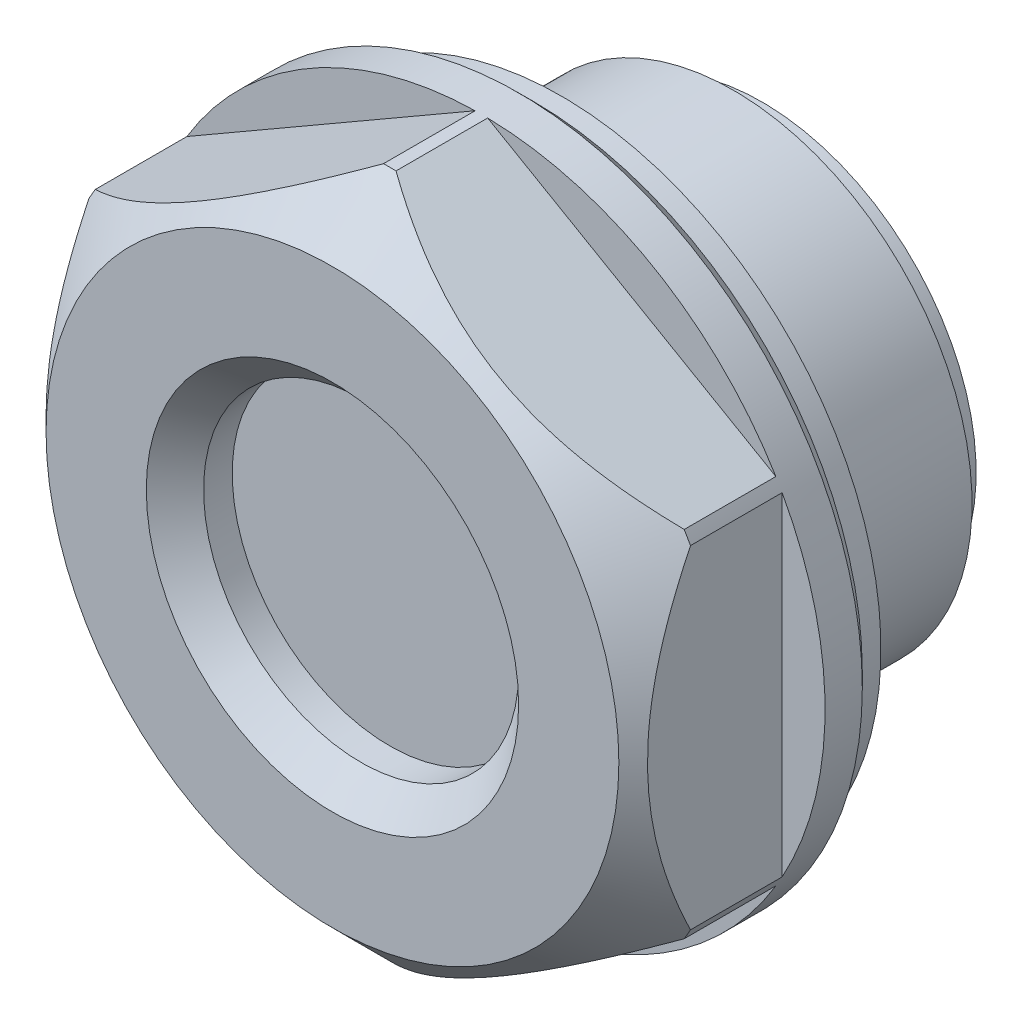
ISO-10303-21;
HEADER;
FILE_DESCRIPTION(('STEP AP214'),'2;1');
FILE_NAME('part.step','',(''),(''),'','','');
FILE_SCHEMA(('AUTOMOTIVE_DESIGN { 1 0 10303 214 1 1 1 1 }'));
ENDSEC;
DATA;
#1=APPLICATION_CONTEXT('core data for automotive mechanical design processes');
#2=APPLICATION_PROTOCOL_DEFINITION('international standard','automotive_design',2000,#1);
#3=PRODUCT_CONTEXT('',#1,'mechanical');
#4=PRODUCT('Part','Part','',(#3));
#5=PRODUCT_RELATED_PRODUCT_CATEGORY('part','',(#4));
#6=PRODUCT_DEFINITION_FORMATION('','',#4);
#7=PRODUCT_DEFINITION_CONTEXT('part definition',#1,'design');
#8=PRODUCT_DEFINITION('design','',#6,#7);
#9=PRODUCT_DEFINITION_SHAPE('','',#8);
#10=(LENGTH_UNIT() NAMED_UNIT(*) SI_UNIT(.MILLI.,.METRE.));
#11=(NAMED_UNIT(*) PLANE_ANGLE_UNIT() SI_UNIT($,.RADIAN.));
#12=(NAMED_UNIT(*) SI_UNIT($,.STERADIAN.) SOLID_ANGLE_UNIT());
#13=UNCERTAINTY_MEASURE_WITH_UNIT(LENGTH_MEASURE(1.E-05),#10,'distance_accuracy_value','');
#14=(GEOMETRIC_REPRESENTATION_CONTEXT(3) GLOBAL_UNCERTAINTY_ASSIGNED_CONTEXT((#13)) GLOBAL_UNIT_ASSIGNED_CONTEXT((#10,
#11,#12)) REPRESENTATION_CONTEXT('',''));
#15=CARTESIAN_POINT('',(0.,0.,0.));
#16=DIRECTION('',(0.,0.,1.));
#17=DIRECTION('',(1.,0.,0.));
#18=AXIS2_PLACEMENT_3D('',#15,#16,#17);
#19=CARTESIAN_POINT('',(0.,0.,8.));
#20=DIRECTION('',(0.,0.,-1.));
#21=DIRECTION('',(-1.,0.,0.));
#22=AXIS2_PLACEMENT_3D('',#19,#20,#21);
#23=CONICAL_SURFACE('',#22,10.,0.785398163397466);
#24=CARTESIAN_POINT('',(0.,0.,8.));
#25=DIRECTION('',(0.,0.,-1.));
#26=DIRECTION('',(-1.,0.,0.));
#27=AXIS2_PLACEMENT_3D('',#24,#25,#26);
#28=CIRCLE('',#27,10.);
#29=CARTESIAN_POINT('',(-10.,0.,8.));
#30=VERTEX_POINT('',#29);
#31=EDGE_CURVE('E220',#30,#30,#28,.T.);
#32=ORIENTED_EDGE('',*,*,#31,.T.);
#33=EDGE_LOOP('',(#32));
#34=FACE_BOUND('',#33,.T.);
#35=CARTESIAN_POINT('',(0.,0.,6.00000000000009));
#36=DIRECTION('',(0.,0.,-1.));
#37=DIRECTION('',(-1.,0.,0.));
#38=AXIS2_PLACEMENT_3D('',#35,#36,#37);
#39=CIRCLE('',#38,12.);
#40=CARTESIAN_POINT('',(-10.2811529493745,-6.18852923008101,6.0000000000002));
#41=VERTEX_POINT('',#40);
#42=CARTESIAN_POINT('',(-10.5,-5.80947501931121,6.00000000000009));
#43=VERTEX_POINT('',#42);
#44=EDGE_CURVE('E222',#41,#43,#39,.T.);
#45=ORIENTED_EDGE('',*,*,#44,.F.);
#46=CARTESIAN_POINT('',(-10.2813529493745,-6.18841376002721,5.9998881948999));
#47=CARTESIAN_POINT('',(-10.1071583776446,-6.28898504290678,6.09725022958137));
#48=CARTESIAN_POINT('',(-9.93167547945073,-6.39030014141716,6.19149656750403));
#49=CARTESIAN_POINT('',(-9.57786885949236,-6.59457048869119,6.37286421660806));
#50=CARTESIAN_POINT('',(-9.39954375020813,-6.69752653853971,6.45998191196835));
#51=CARTESIAN_POINT('',(-8.85846736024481,-7.00991713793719,6.70994526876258));
#52=CARTESIAN_POINT('',(-8.49126575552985,-7.22192108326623,6.86045836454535));
#53=CARTESIAN_POINT('',(-7.93494901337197,-7.54311070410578,7.0537218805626));
#54=CARTESIAN_POINT('',(-7.74992935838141,-7.64993185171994,7.11241954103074));
#55=CARTESIAN_POINT('',(-7.37748020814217,-7.86496546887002,7.21846513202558));
#56=CARTESIAN_POINT('',(-7.1900512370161,-7.97317763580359,7.26581548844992));
#57=CARTESIAN_POINT('',(-6.81351822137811,-8.19056907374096,7.34805197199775));
#58=CARTESIAN_POINT('',(-6.62441815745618,-8.29974604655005,7.38296223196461));
#59=CARTESIAN_POINT('',(-6.24476910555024,-8.51893652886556,7.43959542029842));
#60=CARTESIAN_POINT('',(-6.05422030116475,-8.62894993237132,7.46131999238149));
#61=CARTESIAN_POINT('',(-5.57903999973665,-8.90329540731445,7.49821883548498));
#62=CARTESIAN_POINT('',(-5.29388349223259,-9.06793059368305,7.50502017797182));
#63=CARTESIAN_POINT('',(-4.72422477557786,-9.39682320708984,7.48760906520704));
#64=CARTESIAN_POINT('',(-4.43972281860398,-9.5610804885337,7.46338618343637));
#65=CARTESIAN_POINT('',(-3.87355290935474,-9.88795883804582,7.38535655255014));
#66=CARTESIAN_POINT('',(-3.59188790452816,-10.0505782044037,7.33152173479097));
#67=CARTESIAN_POINT('',(-3.03346083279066,-10.3729862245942,7.19716647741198));
#68=CARTESIAN_POINT('',(-2.75669833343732,-10.5327751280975,7.11664840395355));
#69=CARTESIAN_POINT('',(-2.28772625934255,-10.8035362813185,6.95900643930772));
#70=CARTESIAN_POINT('',(-2.09405788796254,-10.9153507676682,6.88754708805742));
#71=CARTESIAN_POINT('',(-1.70984459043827,-11.1371764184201,6.73425751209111));
#72=CARTESIAN_POINT('',(-1.51929943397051,-11.2471877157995,6.65242805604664));
#73=CARTESIAN_POINT('',(-1.14195874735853,-11.4650454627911,6.47995661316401));
#74=CARTESIAN_POINT('',(-0.955153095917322,-11.5728977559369,6.38934393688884));
#75=CARTESIAN_POINT('',(-0.584628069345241,-11.7868204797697,6.20024466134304));
#76=CARTESIAN_POINT('',(-0.400907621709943,-11.8928915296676,6.10176086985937));
#77=CARTESIAN_POINT('',(-0.218647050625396,-11.9981197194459,5.9998881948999));
#78=B_SPLINE_CURVE_WITH_KNOTS('',3,(#46,#47,#48,#49,#50,#51,#52,#53,#54,#55,#56,#57,#58,#59,#60,
#61,#62,#63,#64,#65,#66,#67,#68,#69,#70,#71,#72,#73,#74,#75,#76,#77),.UNSPECIFIED.,.F.,.F.,(4,2,
2,2,2,2,2,2,2,2,2,2,2,2,2,4),(0.,0.670320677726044,1.34097927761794,2.68866206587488,
3.35309385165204,4.01738346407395,4.680377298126,5.34328846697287,6.32976728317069,
7.31657771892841,8.30432515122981,9.2919850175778,9.99603716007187,10.7000371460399,
11.4017637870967,12.1032412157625),.UNSPECIFIED.);
#79=CARTESIAN_POINT('',(-0.218847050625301,-11.9980042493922,6.00000000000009));
#80=VERTEX_POINT('',#79);
#81=EDGE_CURVE('E127',#41,#80,#78,.T.);
#82=ORIENTED_EDGE('',*,*,#81,.T.);
#83=CARTESIAN_POINT('',(0.218847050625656,-11.9980042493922,6.00000000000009));
#84=VERTEX_POINT('',#83);
#85=EDGE_CURVE('E225',#84,#80,#39,.T.);
#86=ORIENTED_EDGE('',*,*,#85,.F.);
#87=CARTESIAN_POINT('',(10.2813529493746,-6.18841376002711,5.9998881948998));
#88=CARTESIAN_POINT('',(10.1071583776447,-6.28898504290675,6.09725022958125));
#89=CARTESIAN_POINT('',(9.93167547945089,-6.39030014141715,6.19149656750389));
#90=CARTESIAN_POINT('',(9.57786885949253,-6.5945704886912,6.37286421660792));
#91=CARTESIAN_POINT('',(9.3995437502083,-6.69752653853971,6.45998191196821));
#92=CARTESIAN_POINT('',(8.85846736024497,-7.00991713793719,6.70994526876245));
#93=CARTESIAN_POINT('',(8.49126575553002,-7.22192108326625,6.86045836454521));
#94=CARTESIAN_POINT('',(7.93494901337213,-7.54311070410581,7.05372188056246));
#95=CARTESIAN_POINT('',(7.74992935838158,-7.64993185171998,7.1124195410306));
#96=CARTESIAN_POINT('',(7.37748020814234,-7.86496546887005,7.21846513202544));
#97=CARTESIAN_POINT('',(7.19005123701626,-7.97317763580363,7.26581548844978));
#98=CARTESIAN_POINT('',(6.81351822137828,-8.19056907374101,7.34805197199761));
#99=CARTESIAN_POINT('',(6.62441815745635,-8.29974604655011,7.38296223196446));
#100=CARTESIAN_POINT('',(6.24476910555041,-8.51893652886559,7.43959542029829));
#101=CARTESIAN_POINT('',(6.0542203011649,-8.62894993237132,7.46131999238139));
#102=CARTESIAN_POINT('',(5.5790399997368,-8.90329540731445,7.49821883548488));
#103=CARTESIAN_POINT('',(5.29388349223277,-9.06793059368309,7.50502017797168));
#104=CARTESIAN_POINT('',(4.72422477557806,-9.39682320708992,7.48760906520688));
#105=CARTESIAN_POINT('',(4.43972281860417,-9.56108048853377,7.46338618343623));
#106=CARTESIAN_POINT('',(3.87355290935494,-9.88795883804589,7.38535655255));
#107=CARTESIAN_POINT('',(3.59188790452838,-10.0505782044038,7.33152173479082));
#108=CARTESIAN_POINT('',(3.03346083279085,-10.3729862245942,7.19716647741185));
#109=CARTESIAN_POINT('',(2.75669833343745,-10.5327751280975,7.11664840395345));
#110=CARTESIAN_POINT('',(2.28772625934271,-10.8035362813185,6.95900643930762));
#111=CARTESIAN_POINT('',(2.09405788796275,-10.9153507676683,6.8875470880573));
#112=CARTESIAN_POINT('',(1.70984459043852,-11.1371764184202,6.73425751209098));
#113=CARTESIAN_POINT('',(1.51929943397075,-11.2471877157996,6.65242805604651));
#114=CARTESIAN_POINT('',(1.14195874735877,-11.4650454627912,6.47995661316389));
#115=CARTESIAN_POINT('',(0.955153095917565,-11.572897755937,6.38934393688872));
#116=CARTESIAN_POINT('',(0.584628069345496,-11.7868204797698,6.20024466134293));
#117=CARTESIAN_POINT('',(0.400907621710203,-11.8928915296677,6.10176086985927));
#118=CARTESIAN_POINT('',(0.218647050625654,-11.998119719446,5.9998881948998));
#119=B_SPLINE_CURVE_WITH_KNOTS('',3,(#87,#88,#89,#90,#91,#92,#93,#94,#95,#96,#97,#98,#99,#100,
#101,#102,#103,#104,#105,#106,#107,#108,#109,#110,#111,#112,#113,#114,#115,#116,#117,#118),
.UNSPECIFIED.,.F.,.F.,(4,2,2,2,2,2,2,2,2,2,2,2,2,2,2,4),(0.,0.670320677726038,1.34097927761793,
2.68866206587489,3.35309385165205,4.01738346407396,4.68037729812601,5.34328846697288,
6.32976728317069,7.31657771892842,8.30432515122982,9.2919850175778,9.99603716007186,
10.7000371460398,11.4017637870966,12.1032412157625),.UNSPECIFIED.);
#120=CARTESIAN_POINT('',(10.2811529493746,-6.18852923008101,6.00000000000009));
#121=VERTEX_POINT('',#120);
#122=EDGE_CURVE('E111',#121,#84,#119,.T.);
#123=ORIENTED_EDGE('',*,*,#122,.F.);
#124=CARTESIAN_POINT('',(10.5,-5.80947501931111,6.00000000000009));
#125=VERTEX_POINT('',#124);
#126=EDGE_CURVE('E228',#125,#121,#39,.T.);
#127=ORIENTED_EDGE('',*,*,#126,.F.);
#128=CARTESIAN_POINT('',(10.5,-12.032043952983,2.0306518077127));
#129=CARTESIAN_POINT('',(10.5,-11.7388121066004,2.25153591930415));
#130=CARTESIAN_POINT('',(10.5,-11.4439319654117,2.47026759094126));
#131=CARTESIAN_POINT('',(10.5,-10.8502274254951,2.90246444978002));
#132=CARTESIAN_POINT('',(10.5,-10.5514020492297,3.11592829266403));
#133=CARTESIAN_POINT('',(10.5,-9.94697374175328,3.53814509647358));
#134=CARTESIAN_POINT('',(10.5,-9.6413362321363,3.74684872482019));
#135=CARTESIAN_POINT('',(10.5,-9.02486334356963,4.15640757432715));
#136=CARTESIAN_POINT('',(10.5,-8.71402833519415,4.35726335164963));
#137=CARTESIAN_POINT('',(10.5,-8.06860183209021,4.76046591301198));
#138=CARTESIAN_POINT('',(10.5,-7.73366048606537,4.96225551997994));
#139=CARTESIAN_POINT('',(10.5,-7.05596601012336,5.35247531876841));
#140=CARTESIAN_POINT('',(10.5,-6.71321166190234,5.54090340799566));
#141=CARTESIAN_POINT('',(10.5,-6.01993639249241,5.90032914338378));
#142=CARTESIAN_POINT('',(10.5,-5.66944225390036,6.07137804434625));
#143=CARTESIAN_POINT('',(10.5,-4.95893344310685,6.3922167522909));
#144=CARTESIAN_POINT('',(10.5,-4.59892314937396,6.5420161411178));
#145=CARTESIAN_POINT('',(10.5,-3.89749178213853,6.8043230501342));
#146=CARTESIAN_POINT('',(10.5,-3.55682782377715,6.91883411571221));
#147=CARTESIAN_POINT('',(10.5,-2.86734915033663,7.12051813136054));
#148=CARTESIAN_POINT('',(10.5,-2.51853387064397,7.20768918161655));
#149=CARTESIAN_POINT('',(10.5,-1.82060908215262,7.34870759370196));
#150=CARTESIAN_POINT('',(10.5,-1.47161611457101,7.40312236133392));
#151=CARTESIAN_POINT('',(10.5,-0.769963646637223,7.47758125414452));
#152=CARTESIAN_POINT('',(10.5,-0.417304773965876,7.49763116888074));
#153=CARTESIAN_POINT('',(10.5,0.275709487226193,7.50189512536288));
#154=CARTESIAN_POINT('',(10.5,0.616057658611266,7.48735486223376));
#155=CARTESIAN_POINT('',(10.5,1.2938100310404,7.42597649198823));
#156=CARTESIAN_POINT('',(10.5,1.6312139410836,7.37913522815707));
#157=CARTESIAN_POINT('',(10.5,2.3063393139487,7.25490378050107));
#158=CARTESIAN_POINT('',(10.5,2.64396395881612,7.17699574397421));
#159=CARTESIAN_POINT('',(10.5,3.31186392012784,6.99476828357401));
#160=CARTESIAN_POINT('',(10.5,3.64213986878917,6.89045114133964));
#161=CARTESIAN_POINT('',(10.5,4.32659456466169,6.64847521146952));
#162=CARTESIAN_POINT('',(10.5,4.67996694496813,6.50855817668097));
#163=CARTESIAN_POINT('',(10.5,5.37752120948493,6.20726118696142));
#164=CARTESIAN_POINT('',(10.5,5.72169870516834,6.04587119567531));
#165=CARTESIAN_POINT('',(10.5,6.40255224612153,5.70546986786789));
#166=CARTESIAN_POINT('',(10.5,6.73920034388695,5.52640308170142));
#167=CARTESIAN_POINT('',(10.5,7.4047452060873,5.1546080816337));
#168=CARTESIAN_POINT('',(10.5,7.73364319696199,4.96188204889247));
#169=CARTESIAN_POINT('',(10.5,8.36850190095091,4.57533449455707));
#170=CARTESIAN_POINT('',(10.5,8.67478892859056,4.38204607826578));
#171=CARTESIAN_POINT('',(10.5,9.28210537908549,3.98735397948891));
#172=CARTESIAN_POINT('',(10.5,9.58313440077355,3.78594968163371));
#173=CARTESIAN_POINT('',(10.5,10.1781795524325,3.37814340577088));
#174=CARTESIAN_POINT('',(10.5,10.472232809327,3.17179540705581));
#175=CARTESIAN_POINT('',(10.5,11.0563228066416,2.7536521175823));
#176=CARTESIAN_POINT('',(10.5,11.3463606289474,2.54185833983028));
#177=CARTESIAN_POINT('',(10.5,11.6347173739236,2.32783842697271));
#178=B_SPLINE_CURVE_WITH_KNOTS('',3,(#128,#129,#130,#131,#132,#133,#134,#135,#136,#137,#138,
#139,#140,#141,#142,#143,#144,#145,#146,#147,#148,#149,#150,#151,#152,#153,#154,#155,#156,#157,
#158,#159,#160,#161,#162,#163,#164,#165,#166,#167,#168,#169,#170,#171,#172,#173,#174,#175,#176,
#177),.UNSPECIFIED.,.F.,.F.,(4,2,2,2,2,2,2,2,2,2,2,2,2,2,2,2,2,2,2,2,2,2,2,2,4),(0.,
1.1013722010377,2.20302261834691,3.31321111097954,4.4233207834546,5.5961640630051,
6.76919149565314,7.93865237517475,9.10758423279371,10.1848198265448,11.2621302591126,
12.320198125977,13.3780877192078,14.3984594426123,15.4189308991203,16.4571756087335,
17.4953306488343,18.6346340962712,19.7744719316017,20.9180063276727,22.0613585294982,
23.1477390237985,24.2342020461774,25.3118274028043,26.3891565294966),.UNSPECIFIED.);
#179=CARTESIAN_POINT('',(10.5,5.80947501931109,6.00000000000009));
#180=VERTEX_POINT('',#179);
#181=EDGE_CURVE('E253',#125,#180,#178,.T.);
#182=ORIENTED_EDGE('',*,*,#181,.T.);
#183=CARTESIAN_POINT('',(10.2811529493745,6.18852923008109,6.00000000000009));
#184=VERTEX_POINT('',#183);
#185=EDGE_CURVE('E240',#184,#180,#39,.T.);
#186=ORIENTED_EDGE('',*,*,#185,.F.);
#187=CARTESIAN_POINT('',(0.218647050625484,11.998119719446,5.9998881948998));
#188=CARTESIAN_POINT('',(0.392841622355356,11.8975484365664,6.09725022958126));
#189=CARTESIAN_POINT('',(0.568324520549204,11.796233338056,6.19149656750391));
#190=CARTESIAN_POINT('',(0.922131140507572,11.591962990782,6.37286421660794));
#191=CARTESIAN_POINT('',(1.1004562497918,11.4890069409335,6.45998191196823));
#192=CARTESIAN_POINT('',(1.64153263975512,11.176616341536,6.70994526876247));
#193=CARTESIAN_POINT('',(2.00873424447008,10.9646123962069,6.86045836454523));
#194=CARTESIAN_POINT('',(2.56505098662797,10.6434227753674,7.05372188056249));
#195=CARTESIAN_POINT('',(2.75007064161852,10.5366016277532,7.11241954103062));
#196=CARTESIAN_POINT('',(3.12251979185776,10.3215680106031,7.21846513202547));
#197=CARTESIAN_POINT('',(3.30994876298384,10.2133558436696,7.2658154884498));
#198=CARTESIAN_POINT('',(3.68648177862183,9.9959644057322,7.34805197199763));
#199=CARTESIAN_POINT('',(3.87558184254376,9.8867874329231,7.38296223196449));
#200=CARTESIAN_POINT('',(4.2552308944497,9.66759695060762,7.43959542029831));
#201=CARTESIAN_POINT('',(4.44577969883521,9.55758354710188,7.46131999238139));
#202=CARTESIAN_POINT('',(4.92096000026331,9.28323807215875,7.49821883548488));
#203=CARTESIAN_POINT('',(5.20611650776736,9.11860288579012,7.50502017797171));
#204=CARTESIAN_POINT('',(5.77577522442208,8.78971027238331,7.48760906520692));
#205=CARTESIAN_POINT('',(6.06027718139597,8.62545299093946,7.46338618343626));
#206=CARTESIAN_POINT('',(6.62644709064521,8.29857464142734,7.38535655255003));
#207=CARTESIAN_POINT('',(6.90811209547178,8.13595527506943,7.33152173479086));
#208=CARTESIAN_POINT('',(7.4665391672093,7.81354725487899,7.19716647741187));
#209=CARTESIAN_POINT('',(7.74330166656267,7.65375835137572,7.11664840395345));
#210=CARTESIAN_POINT('',(8.21227374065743,7.3829971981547,6.95900643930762));
#211=CARTESIAN_POINT('',(8.40594211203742,7.27118271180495,6.88754708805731));
#212=CARTESIAN_POINT('',(8.79015540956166,7.0493570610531,6.73425751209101));
#213=CARTESIAN_POINT('',(8.98070056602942,6.93934576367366,6.65242805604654));
#214=CARTESIAN_POINT('',(9.3580412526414,6.72148801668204,6.47995661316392));
#215=CARTESIAN_POINT('',(9.5448469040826,6.61363572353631,6.38934393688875));
#216=CARTESIAN_POINT('',(9.91537193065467,6.39971299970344,6.20024466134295));
#217=CARTESIAN_POINT('',(10.09909237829,6.29364194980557,6.10176086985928));
#218=CARTESIAN_POINT('',(10.2813529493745,6.18841376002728,5.9998881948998));
#219=B_SPLINE_CURVE_WITH_KNOTS('',3,(#187,#188,#189,#190,#191,#192,#193,#194,#195,#196,#197,
#198,#199,#200,#201,#202,#203,#204,#205,#206,#207,#208,#209,#210,#211,#212,#213,#214,#215,#216,
#217,#218),.UNSPECIFIED.,.F.,.F.,(4,2,2,2,2,2,2,2,2,2,2,2,2,2,2,4),(0.,0.670320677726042,
1.34097927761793,2.68866206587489,3.35309385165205,4.01738346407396,4.68037729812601,
5.34328846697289,6.32976728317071,7.31657771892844,8.30432515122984,9.29198501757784,
9.99603716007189,10.7000371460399,11.4017637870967,12.1032412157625),.UNSPECIFIED.);
#220=CARTESIAN_POINT('',(0.218847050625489,11.9980042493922,6.00000000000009));
#221=VERTEX_POINT('',#220);
#222=EDGE_CURVE('E255',#221,#184,#219,.T.);
#223=ORIENTED_EDGE('',*,*,#222,.F.);
#224=CARTESIAN_POINT('',(-0.218847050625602,11.9980042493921,6.00000000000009));
#225=VERTEX_POINT('',#224);
#226=EDGE_CURVE('E234',#225,#221,#39,.T.);
#227=ORIENTED_EDGE('',*,*,#226,.F.);
#228=CARTESIAN_POINT('',(-0.218647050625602,11.9981197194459,5.9998881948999));
#229=CARTESIAN_POINT('',(-0.392841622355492,11.8975484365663,6.09725022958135));
#230=CARTESIAN_POINT('',(-0.568324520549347,11.7962333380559,6.19149656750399));
#231=CARTESIAN_POINT('',(-0.922131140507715,11.5919629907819,6.37286421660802));
#232=CARTESIAN_POINT('',(-1.10045624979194,11.4890069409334,6.45998191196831));
#233=CARTESIAN_POINT('',(-1.64153263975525,11.1766163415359,6.70994526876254));
#234=CARTESIAN_POINT('',(-2.00873424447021,10.9646123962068,6.8604583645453));
#235=CARTESIAN_POINT('',(-2.56505098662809,10.6434227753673,7.05372188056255));
#236=CARTESIAN_POINT('',(-2.75007064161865,10.5366016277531,7.11241954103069));
#237=CARTESIAN_POINT('',(-3.12251979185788,10.321568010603,7.21846513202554));
#238=CARTESIAN_POINT('',(-3.30994876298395,10.2133558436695,7.26581548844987));
#239=CARTESIAN_POINT('',(-3.68648177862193,9.9959644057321,7.3480519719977));
#240=CARTESIAN_POINT('',(-3.87558184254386,9.88678743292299,7.38296223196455));
#241=CARTESIAN_POINT('',(-4.25523089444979,9.66759695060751,7.43959542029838));
#242=CARTESIAN_POINT('',(-4.44577969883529,9.55758354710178,7.46131999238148));
#243=CARTESIAN_POINT('',(-4.92096000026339,9.28323807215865,7.49821883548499));
#244=CARTESIAN_POINT('',(-5.20611650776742,9.11860288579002,7.50502017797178));
#245=CARTESIAN_POINT('',(-5.77577522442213,8.7897102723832,7.48760906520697));
#246=CARTESIAN_POINT('',(-6.06027718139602,8.62545299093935,7.46338618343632));
#247=CARTESIAN_POINT('',(-6.62644709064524,8.29857464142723,7.3853565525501));
#248=CARTESIAN_POINT('',(-6.9081120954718,8.13595527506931,7.33152173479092));
#249=CARTESIAN_POINT('',(-7.46653916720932,7.81354725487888,7.19716647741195));
#250=CARTESIAN_POINT('',(-7.7433016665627,7.65375835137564,7.11664840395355));
#251=CARTESIAN_POINT('',(-8.21227374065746,7.3829971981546,6.95900643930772));
#252=CARTESIAN_POINT('',(-8.40594211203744,7.27118271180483,6.88754708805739));
#253=CARTESIAN_POINT('',(-8.79015540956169,7.04935706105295,6.73425751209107));
#254=CARTESIAN_POINT('',(-8.98070056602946,6.9393457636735,6.6524280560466));
#255=CARTESIAN_POINT('',(-9.35804125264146,6.72148801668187,6.47995661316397));
#256=CARTESIAN_POINT('',(-9.54484690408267,6.61363572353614,6.38934393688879));
#257=CARTESIAN_POINT('',(-9.91537193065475,6.39971299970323,6.200244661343));
#258=CARTESIAN_POINT('',(-10.09909237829,6.29364194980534,6.10176086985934));
#259=CARTESIAN_POINT('',(-10.2813529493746,6.18841376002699,5.9998881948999));
#260=B_SPLINE_CURVE_WITH_KNOTS('',3,(#228,#229,#230,#231,#232,#233,#234,#235,#236,#237,#238,
#239,#240,#241,#242,#243,#244,#245,#246,#247,#248,#249,#250,#251,#252,#253,#254,#255,#256,#257,
#258,#259),.UNSPECIFIED.,.F.,.F.,(4,2,2,2,2,2,2,2,2,2,2,2,2,2,2,4),(0.,0.670320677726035,
1.34097927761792,2.68866206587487,3.35309385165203,4.01738346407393,4.68037729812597,
5.34328846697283,6.32976728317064,7.31657771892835,8.30432515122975,9.29198501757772,
9.99603716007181,10.7000371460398,11.4017637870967,12.1032412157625),.UNSPECIFIED.);
#261=CARTESIAN_POINT('',(-10.2811529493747,6.1885292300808,6.00000000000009));
#262=VERTEX_POINT('',#261);
#263=EDGE_CURVE('E132',#225,#262,#260,.T.);
#264=ORIENTED_EDGE('',*,*,#263,.T.);
#265=CARTESIAN_POINT('',(-10.5,5.80947501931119,6.00000000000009));
#266=VERTEX_POINT('',#265);
#267=EDGE_CURVE('E227',#266,#262,#39,.T.);
#268=ORIENTED_EDGE('',*,*,#267,.F.);
#269=CARTESIAN_POINT('',(-10.5,-12.0320439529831,2.03065180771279));
#270=CARTESIAN_POINT('',(-10.5,-11.7388121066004,2.25153591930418));
#271=CARTESIAN_POINT('',(-10.5,-11.4439319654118,2.47026759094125));
#272=CARTESIAN_POINT('',(-10.5,-10.8502274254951,2.90246444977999));
#273=CARTESIAN_POINT('',(-10.5,-10.5514020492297,3.115928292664));
#274=CARTESIAN_POINT('',(-10.5,-9.94697374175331,3.53814509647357));
#275=CARTESIAN_POINT('',(-10.5,-9.64133623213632,3.74684872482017));
#276=CARTESIAN_POINT('',(-10.5,-9.02486334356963,4.15640757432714));
#277=CARTESIAN_POINT('',(-10.5,-8.71402833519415,4.35726335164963));
#278=CARTESIAN_POINT('',(-10.5,-8.06860183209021,4.76046591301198));
#279=CARTESIAN_POINT('',(-10.5,-7.73366048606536,4.96225551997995));
#280=CARTESIAN_POINT('',(-10.5,-7.05596601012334,5.35247531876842));
#281=CARTESIAN_POINT('',(-10.5,-6.71321166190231,5.54090340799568));
#282=CARTESIAN_POINT('',(-10.5,-6.01993639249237,5.90032914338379));
#283=CARTESIAN_POINT('',(-10.5,-5.66944225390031,6.07137804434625));
#284=CARTESIAN_POINT('',(-10.5,-4.95893344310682,6.39221675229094));
#285=CARTESIAN_POINT('',(-10.5,-4.59892314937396,6.54201614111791));
#286=CARTESIAN_POINT('',(-10.5,-3.89749178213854,6.80432305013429));
#287=CARTESIAN_POINT('',(-10.5,-3.55682782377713,6.91883411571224));
#288=CARTESIAN_POINT('',(-10.5,-2.8673491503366,7.12051813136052));
#289=CARTESIAN_POINT('',(-10.5,-2.51853387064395,7.20768918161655));
#290=CARTESIAN_POINT('',(-10.5,-1.8206090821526,7.34870759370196));
#291=CARTESIAN_POINT('',(-10.5,-1.47161611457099,7.4031223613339));
#292=CARTESIAN_POINT('',(-10.5,-0.769963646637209,7.47758125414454));
#293=CARTESIAN_POINT('',(-10.5,-0.417304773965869,7.49763116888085));
#294=CARTESIAN_POINT('',(-10.5,0.275709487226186,7.50189512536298));
#295=CARTESIAN_POINT('',(-10.5,0.616057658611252,7.48735486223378));
#296=CARTESIAN_POINT('',(-10.5,1.29381003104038,7.42597649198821));
#297=CARTESIAN_POINT('',(-10.5,1.63121394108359,7.37913522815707));
#298=CARTESIAN_POINT('',(-10.5,2.30633931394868,7.25490378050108));
#299=CARTESIAN_POINT('',(-10.5,2.64396395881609,7.1769957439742));
#300=CARTESIAN_POINT('',(-10.5,3.31186392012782,6.99476828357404));
#301=CARTESIAN_POINT('',(-10.5,3.64213986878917,6.89045114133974));
#302=CARTESIAN_POINT('',(-10.5,4.32659456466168,6.64847521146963));
#303=CARTESIAN_POINT('',(-10.5,4.67996694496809,6.50855817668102));
#304=CARTESIAN_POINT('',(-10.5,5.37752120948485,6.20726118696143));
#305=CARTESIAN_POINT('',(-10.5,5.72169870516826,6.04587119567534));
#306=CARTESIAN_POINT('',(-10.5,6.40255224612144,5.70546986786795));
#307=CARTESIAN_POINT('',(-10.5,6.73920034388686,5.52640308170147));
#308=CARTESIAN_POINT('',(-10.5,7.40474520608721,5.15460808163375));
#309=CARTESIAN_POINT('',(-10.5,7.7336431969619,4.96188204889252));
#310=CARTESIAN_POINT('',(-10.5,8.36850190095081,4.57533449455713));
#311=CARTESIAN_POINT('',(-10.5,8.67478892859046,4.38204607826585));
#312=CARTESIAN_POINT('',(-10.5,9.28210537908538,3.98735397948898));
#313=CARTESIAN_POINT('',(-10.5,9.58313440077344,3.78594968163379));
#314=CARTESIAN_POINT('',(-10.5,10.1781795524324,3.37814340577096));
#315=CARTESIAN_POINT('',(-10.5,10.4722328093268,3.1717954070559));
#316=CARTESIAN_POINT('',(-10.5,11.0563228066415,2.75365211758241));
#317=CARTESIAN_POINT('',(-10.5,11.3463606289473,2.54185833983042));
#318=CARTESIAN_POINT('',(-10.5,11.6347173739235,2.3278384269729));
#319=B_SPLINE_CURVE_WITH_KNOTS('',3,(#269,#270,#271,#272,#273,#274,#275,#276,#277,#278,#279,
#280,#281,#282,#283,#284,#285,#286,#287,#288,#289,#290,#291,#292,#293,#294,#295,#296,#297,#298,
#299,#300,#301,#302,#303,#304,#305,#306,#307,#308,#309,#310,#311,#312,#313,#314,#315,#316,#317,
#318),.UNSPECIFIED.,.F.,.F.,(4,2,2,2,2,2,2,2,2,2,2,2,2,2,2,2,2,2,2,2,2,2,2,2,4),(0.,
1.10137220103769,2.2030226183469,3.31321111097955,4.42332078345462,5.59616406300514,
6.76919149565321,7.93865237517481,9.10758423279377,10.1848198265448,11.2621302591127,
12.320198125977,13.3780877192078,14.3984594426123,15.4189308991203,16.4571756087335,
17.4953306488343,18.6346340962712,19.7744719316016,20.9180063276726,22.0613585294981,
23.1477390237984,24.2342020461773,25.3118274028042,26.3891565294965),.UNSPECIFIED.);
#320=EDGE_CURVE('E129',#43,#266,#319,.T.);
#321=ORIENTED_EDGE('',*,*,#320,.F.);
#322=EDGE_LOOP('',(#45,#82,#86,#123,#127,#182,#186,#223,#227,#264,#268,#321));
#323=FACE_BOUND('',#322,.T.);
#324=ADVANCED_FACE('F14',(#34,#323),#23,.T.);
#325=CARTESIAN_POINT('',(0.,11.5,1.));
#326=DIRECTION('',(0.,0.,1.));
#327=DIRECTION('',(1.,0.,0.));
#328=AXIS2_PLACEMENT_3D('',#325,#326,#327);
#329=PLANE('',#328);
#330=CARTESIAN_POINT('',(0.,0.,1.));
#331=DIRECTION('',(0.,0.,-1.));
#332=DIRECTION('',(-1.,0.,0.));
#333=AXIS2_PLACEMENT_3D('',#330,#331,#332);
#334=CIRCLE('',#333,11.15);
#335=CARTESIAN_POINT('',(-11.15,0.,1.));
#336=VERTEX_POINT('',#335);
#337=EDGE_CURVE('E319',#336,#336,#334,.T.);
#338=ORIENTED_EDGE('',*,*,#337,.F.);
#339=EDGE_LOOP('',(#338));
#340=FACE_BOUND('',#339,.T.);
#341=CARTESIAN_POINT('',(0.,0.,1.));
#342=DIRECTION('',(0.,0.,-1.));
#343=DIRECTION('',(-1.,0.,0.));
#344=AXIS2_PLACEMENT_3D('',#341,#342,#343);
#345=CIRCLE('',#344,11.5);
#346=CARTESIAN_POINT('',(-11.5,0.,1.));
#347=VERTEX_POINT('',#346);
#348=EDGE_CURVE('E238',#347,#347,#345,.T.);
#349=ORIENTED_EDGE('',*,*,#348,.T.);
#350=EDGE_LOOP('',(#349));
#351=FACE_BOUND('',#350,.T.);
#352=ADVANCED_FACE('F16',(#340,#351),#329,.F.);
#353=CARTESIAN_POINT('',(0.,0.,1.));
#354=DIRECTION('',(0.,0.,1.));
#355=DIRECTION('',(1.,0.,0.));
#356=AXIS2_PLACEMENT_3D('',#353,#354,#355);
#357=CONICAL_SURFACE('',#356,11.5,0.785398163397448);
#358=CARTESIAN_POINT('',(0.,0.,1.5));
#359=DIRECTION('',(0.,0.,-1.));
#360=DIRECTION('',(-1.,0.,0.));
#361=AXIS2_PLACEMENT_3D('',#358,#359,#360);
#362=CIRCLE('',#361,12.);
#363=CARTESIAN_POINT('',(-12.,0.,1.5));
#364=VERTEX_POINT('',#363);
#365=EDGE_CURVE('E233',#364,#364,#362,.T.);
#366=ORIENTED_EDGE('',*,*,#365,.T.);
#367=EDGE_LOOP('',(#366));
#368=FACE_BOUND('',#367,.T.);
#369=ORIENTED_EDGE('',*,*,#348,.F.);
#370=EDGE_LOOP('',(#369));
#371=FACE_BOUND('',#370,.T.);
#372=ADVANCED_FACE('F208',(#368,#371),#357,.T.);
#373=CARTESIAN_POINT('',(0.,0.,-10.5493874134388));
#374=DIRECTION('',(0.,0.,-1.));
#375=DIRECTION('',(-1.,0.,0.));
#376=AXIS2_PLACEMENT_3D('',#373,#374,#375);
#377=CYLINDRICAL_SURFACE('',#376,12.);
#378=DIRECTION('',(0.,0.,1.));
#379=VECTOR('',#378,1.);
#380=CARTESIAN_POINT('',(10.2811529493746,-6.18852923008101,2.8));
#381=LINE('',#380,#379);
#382=CARTESIAN_POINT('',(10.2811529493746,-6.18852923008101,2.8));
#383=VERTEX_POINT('',#382);
#384=EDGE_CURVE('E116',#383,#121,#381,.T.);
#385=ORIENTED_EDGE('',*,*,#384,.F.);
#386=CARTESIAN_POINT('',(0.,0.,2.8));
#387=DIRECTION('',(0.,0.,1.));
#388=DIRECTION('',(1.,0.,0.));
#389=AXIS2_PLACEMENT_3D('',#386,#387,#388);
#390=CIRCLE('',#389,12.);
#391=CARTESIAN_POINT('',(0.218847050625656,-11.9980042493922,2.8));
#392=VERTEX_POINT('',#391);
#393=EDGE_CURVE('E23',#392,#383,#390,.T.);
#394=ORIENTED_EDGE('',*,*,#393,.F.);
#395=DIRECTION('',(0.,0.,1.));
#396=VECTOR('',#395,1.);
#397=CARTESIAN_POINT('',(0.218847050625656,-11.9980042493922,2.8));
#398=LINE('',#397,#396);
#399=EDGE_CURVE('E105',#392,#84,#398,.T.);
#400=ORIENTED_EDGE('',*,*,#399,.T.);
#401=ORIENTED_EDGE('',*,*,#85,.T.);
#402=DIRECTION('',(0.,0.,1.));
#403=VECTOR('',#402,1.);
#404=CARTESIAN_POINT('',(-0.218847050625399,-11.9980042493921,2.8));
#405=LINE('',#404,#403);
#406=CARTESIAN_POINT('',(-0.218847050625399,-11.9980042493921,2.8));
#407=VERTEX_POINT('',#406);
#408=EDGE_CURVE('E38',#407,#80,#405,.T.);
#409=ORIENTED_EDGE('',*,*,#408,.F.);
#410=CARTESIAN_POINT('',(-10.2811529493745,-6.18852923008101,2.8));
#411=VERTEX_POINT('',#410);
#412=EDGE_CURVE('E482',#411,#407,#390,.T.);
#413=ORIENTED_EDGE('',*,*,#412,.F.);
#414=DIRECTION('',(0.,0.,1.));
#415=VECTOR('',#414,1.);
#416=CARTESIAN_POINT('',(-10.2811529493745,-6.18852923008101,2.8));
#417=LINE('',#416,#415);
#418=EDGE_CURVE('E307',#411,#41,#417,.T.);
#419=ORIENTED_EDGE('',*,*,#418,.T.);
#420=ORIENTED_EDGE('',*,*,#44,.T.);
#421=DIRECTION('',(0.,0.,1.));
#422=VECTOR('',#421,1.);
#423=CARTESIAN_POINT('',(-10.5,-5.80947501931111,2.8));
#424=LINE('',#423,#422);
#425=CARTESIAN_POINT('',(-10.5,-5.80947501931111,2.8));
#426=VERTEX_POINT('',#425);
#427=EDGE_CURVE('E30',#426,#43,#424,.T.);
#428=ORIENTED_EDGE('',*,*,#427,.F.);
#429=CARTESIAN_POINT('',(-10.5,5.80947501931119,2.8));
#430=VERTEX_POINT('',#429);
#431=EDGE_CURVE('E22',#430,#426,#390,.T.);
#432=ORIENTED_EDGE('',*,*,#431,.F.);
#433=DIRECTION('',(0.,0.,1.));
#434=VECTOR('',#433,1.);
#435=CARTESIAN_POINT('',(-10.5,5.80947501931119,2.8));
#436=LINE('',#435,#434);
#437=EDGE_CURVE('E299',#430,#266,#436,.T.);
#438=ORIENTED_EDGE('',*,*,#437,.T.);
#439=ORIENTED_EDGE('',*,*,#267,.T.);
#440=DIRECTION('',(0.,0.,1.));
#441=VECTOR('',#440,1.);
#442=CARTESIAN_POINT('',(-10.2811529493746,6.1885292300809,2.8));
#443=LINE('',#442,#441);
#444=CARTESIAN_POINT('',(-10.2811529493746,6.1885292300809,2.8));
#445=VERTEX_POINT('',#444);
#446=EDGE_CURVE('E295',#445,#262,#443,.T.);
#447=ORIENTED_EDGE('',*,*,#446,.F.);
#448=CARTESIAN_POINT('',(-0.218847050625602,11.9980042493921,2.8));
#449=VERTEX_POINT('',#448);
#450=EDGE_CURVE('E9',#449,#445,#390,.T.);
#451=ORIENTED_EDGE('',*,*,#450,.F.);
#452=DIRECTION('',(0.,0.,1.));
#453=VECTOR('',#452,1.);
#454=CARTESIAN_POINT('',(-0.218847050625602,11.9980042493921,2.8));
#455=LINE('',#454,#453);
#456=EDGE_CURVE('E293',#449,#225,#455,.T.);
#457=ORIENTED_EDGE('',*,*,#456,.T.);
#458=ORIENTED_EDGE('',*,*,#226,.T.);
#459=DIRECTION('',(0.,0.,1.));
#460=VECTOR('',#459,1.);
#461=CARTESIAN_POINT('',(0.218847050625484,11.9980042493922,2.8));
#462=LINE('',#461,#460);
#463=CARTESIAN_POINT('',(0.218847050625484,11.9980042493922,2.8));
#464=VERTEX_POINT('',#463);
#465=EDGE_CURVE('E297',#464,#221,#462,.T.);
#466=ORIENTED_EDGE('',*,*,#465,.F.);
#467=CARTESIAN_POINT('',(10.2811529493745,6.18852923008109,2.8));
#468=VERTEX_POINT('',#467);
#469=EDGE_CURVE('E128',#468,#464,#390,.T.);
#470=ORIENTED_EDGE('',*,*,#469,.F.);
#471=DIRECTION('',(0.,0.,1.));
#472=VECTOR('',#471,1.);
#473=CARTESIAN_POINT('',(10.2811529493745,6.18852923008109,2.8));
#474=LINE('',#473,#472);
#475=EDGE_CURVE('E301',#468,#184,#474,.T.);
#476=ORIENTED_EDGE('',*,*,#475,.T.);
#477=ORIENTED_EDGE('',*,*,#185,.T.);
#478=DIRECTION('',(0.,0.,1.));
#479=VECTOR('',#478,1.);
#480=CARTESIAN_POINT('',(10.5,5.80947501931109,2.8));
#481=LINE('',#480,#479);
#482=CARTESIAN_POINT('',(10.5,5.80947501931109,2.8));
#483=VERTEX_POINT('',#482);
#484=EDGE_CURVE('E466',#483,#180,#481,.T.);
#485=ORIENTED_EDGE('',*,*,#484,.F.);
#486=CARTESIAN_POINT('',(10.5,-5.80947501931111,2.8));
#487=VERTEX_POINT('',#486);
#488=EDGE_CURVE('E126',#487,#483,#390,.T.);
#489=ORIENTED_EDGE('',*,*,#488,.F.);
#490=DIRECTION('',(0.,0.,1.));
#491=VECTOR('',#490,1.);
#492=CARTESIAN_POINT('',(10.5,-5.80947501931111,2.8));
#493=LINE('',#492,#491);
#494=EDGE_CURVE('E251',#487,#125,#493,.T.);
#495=ORIENTED_EDGE('',*,*,#494,.T.);
#496=ORIENTED_EDGE('',*,*,#126,.T.);
#497=EDGE_LOOP('',(#385,#394,#400,#401,#409,#413,#419,#420,#428,#432,#438,#439,#447,#451,#457,
#458,#466,#470,#476,#477,#485,#489,#495,#496));
#498=FACE_BOUND('',#497,.T.);
#499=ORIENTED_EDGE('',*,*,#365,.F.);
#500=EDGE_LOOP('',(#499));
#501=FACE_BOUND('',#500,.T.);
#502=ADVANCED_FACE('F123',(#498,#501),#377,.T.);
#503=CARTESIAN_POINT('',(0.,10.,8.));
#504=DIRECTION('',(0.,0.,1.));
#505=DIRECTION('',(1.,0.,0.));
#506=AXIS2_PLACEMENT_3D('',#503,#504,#505);
#507=PLANE('',#506);
#508=CARTESIAN_POINT('',(0.,0.,8.));
#509=DIRECTION('',(0.,0.,1.));
#510=DIRECTION('',(1.,0.,0.));
#511=AXIS2_PLACEMENT_3D('',#508,#509,#510);
#512=CIRCLE('',#511,6.5);
#513=CARTESIAN_POINT('',(6.5,0.,8.));
#514=VERTEX_POINT('',#513);
#515=EDGE_CURVE('E310',#514,#514,#512,.T.);
#516=ORIENTED_EDGE('',*,*,#515,.F.);
#517=EDGE_LOOP('',(#516));
#518=FACE_BOUND('',#517,.T.);
#519=ORIENTED_EDGE('',*,*,#31,.F.);
#520=EDGE_LOOP('',(#519));
#521=FACE_BOUND('',#520,.T.);
#522=ADVANCED_FACE('F199',(#518,#521),#507,.T.);
#523=CARTESIAN_POINT('',(0.,7.47500000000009,-7.));
#524=DIRECTION('',(0.,0.,1.));
#525=DIRECTION('',(1.,0.,0.));
#526=AXIS2_PLACEMENT_3D('',#523,#524,#525);
#527=PLANE('',#526);
#528=CARTESIAN_POINT('',(0.,0.,-7.));
#529=DIRECTION('',(0.,0.,-1.));
#530=DIRECTION('',(-1.,0.,0.));
#531=AXIS2_PLACEMENT_3D('',#528,#529,#530);
#532=CIRCLE('',#531,7.475);
#533=CARTESIAN_POINT('',(-7.475,0.,-7.));
#534=VERTEX_POINT('',#533);
#535=EDGE_CURVE('E229',#534,#534,#532,.T.);
#536=ORIENTED_EDGE('',*,*,#535,.T.);
#537=EDGE_LOOP('',(#536));
#538=FACE_BOUND('',#537,.T.);
#539=ADVANCED_FACE('F196',(#538),#527,.F.);
#540=CARTESIAN_POINT('',(0.,0.,-10.5493874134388));
#541=DIRECTION('',(0.,0.,-1.));
#542=DIRECTION('',(-1.,0.,0.));
#543=AXIS2_PLACEMENT_3D('',#540,#541,#542);
#544=CYLINDRICAL_SURFACE('',#543,7.475);
#545=ORIENTED_EDGE('',*,*,#535,.F.);
#546=EDGE_LOOP('',(#545));
#547=FACE_BOUND('',#546,.T.);
#548=CARTESIAN_POINT('',(0.,0.,-6.));
#549=DIRECTION('',(0.,0.,-1.));
#550=DIRECTION('',(-1.,0.,0.));
#551=AXIS2_PLACEMENT_3D('',#548,#549,#550);
#552=CIRCLE('',#551,7.475);
#553=CARTESIAN_POINT('',(-7.475,0.,-6.));
#554=VERTEX_POINT('',#553);
#555=EDGE_CURVE('E331',#554,#554,#552,.T.);
#556=ORIENTED_EDGE('',*,*,#555,.T.);
#557=EDGE_LOOP('',(#556));
#558=FACE_BOUND('',#557,.T.);
#559=ADVANCED_FACE('F192',(#547,#558),#544,.T.);
#560=CARTESIAN_POINT('',(0.,8.331,-6.));
#561=DIRECTION('',(0.,0.,1.));
#562=DIRECTION('',(1.,0.,0.));
#563=AXIS2_PLACEMENT_3D('',#560,#561,#562);
#564=PLANE('',#563);
#565=ORIENTED_EDGE('',*,*,#555,.F.);
#566=EDGE_LOOP('',(#565));
#567=FACE_BOUND('',#566,.T.);
#568=CARTESIAN_POINT('',(0.,0.,-6.));
#569=DIRECTION('',(0.,0.,-1.));
#570=DIRECTION('',(-1.,0.,0.));
#571=AXIS2_PLACEMENT_3D('',#568,#569,#570);
#572=CIRCLE('',#571,8.331);
#573=CARTESIAN_POINT('',(-8.331,0.,-6.));
#574=VERTEX_POINT('',#573);
#575=EDGE_CURVE('E328',#574,#574,#572,.T.);
#576=ORIENTED_EDGE('',*,*,#575,.T.);
#577=EDGE_LOOP('',(#576));
#578=FACE_BOUND('',#577,.T.);
#579=ADVANCED_FACE('F188',(#567,#578),#564,.F.);
#580=CARTESIAN_POINT('',(0.,0.,-10.5493874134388));
#581=DIRECTION('',(0.,0.,-1.));
#582=DIRECTION('',(-1.,0.,0.));
#583=AXIS2_PLACEMENT_3D('',#580,#581,#582);
#584=CYLINDRICAL_SURFACE('',#583,8.331);
#585=ORIENTED_EDGE('',*,*,#575,.F.);
#586=EDGE_LOOP('',(#585));
#587=FACE_BOUND('',#586,.T.);
#588=CARTESIAN_POINT('',(0.,0.,0.));
#589=DIRECTION('',(0.,0.,-1.));
#590=DIRECTION('',(-1.,0.,0.));
#591=AXIS2_PLACEMENT_3D('',#588,#589,#590);
#592=CIRCLE('',#591,8.331);
#593=CARTESIAN_POINT('',(-8.331,0.,0.));
#594=VERTEX_POINT('',#593);
#595=EDGE_CURVE('E325',#594,#594,#592,.T.);
#596=ORIENTED_EDGE('',*,*,#595,.T.);
#597=EDGE_LOOP('',(#596));
#598=FACE_BOUND('',#597,.T.);
#599=ADVANCED_FACE('F184',(#587,#598),#584,.T.);
#600=CARTESIAN_POINT('',(0.,11.15,0.));
#601=DIRECTION('',(0.,0.,1.));
#602=DIRECTION('',(1.,0.,0.));
#603=AXIS2_PLACEMENT_3D('',#600,#601,#602);
#604=PLANE('',#603);
#605=ORIENTED_EDGE('',*,*,#595,.F.);
#606=EDGE_LOOP('',(#605));
#607=FACE_BOUND('',#606,.T.);
#608=CARTESIAN_POINT('',(0.,0.,0.));
#609=DIRECTION('',(0.,0.,-1.));
#610=DIRECTION('',(-1.,0.,0.));
#611=AXIS2_PLACEMENT_3D('',#608,#609,#610);
#612=CIRCLE('',#611,11.15);
#613=CARTESIAN_POINT('',(-11.15,0.,0.));
#614=VERTEX_POINT('',#613);
#615=EDGE_CURVE('E322',#614,#614,#612,.T.);
#616=ORIENTED_EDGE('',*,*,#615,.T.);
#617=EDGE_LOOP('',(#616));
#618=FACE_BOUND('',#617,.T.);
#619=ADVANCED_FACE('F180',(#607,#618),#604,.F.);
#620=CARTESIAN_POINT('',(0.,0.,-10.5493874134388));
#621=DIRECTION('',(0.,0.,-1.));
#622=DIRECTION('',(-1.,0.,0.));
#623=AXIS2_PLACEMENT_3D('',#620,#621,#622);
#624=CYLINDRICAL_SURFACE('',#623,11.15);
#625=ORIENTED_EDGE('',*,*,#615,.F.);
#626=EDGE_LOOP('',(#625));
#627=FACE_BOUND('',#626,.T.);
#628=ORIENTED_EDGE('',*,*,#337,.T.);
#629=EDGE_LOOP('',(#628));
#630=FACE_BOUND('',#629,.T.);
#631=ADVANCED_FACE('F176',(#627,#630),#624,.T.);
#632=CARTESIAN_POINT('',(0.,5.5,6.));
#633=DIRECTION('',(0.,0.,-1.));
#634=DIRECTION('',(-1.,0.,0.));
#635=AXIS2_PLACEMENT_3D('',#632,#633,#634);
#636=PLANE('',#635);
#637=CARTESIAN_POINT('',(0.,0.,6.));
#638=DIRECTION('',(0.,0.,1.));
#639=DIRECTION('',(1.,0.,0.));
#640=AXIS2_PLACEMENT_3D('',#637,#638,#639);
#641=CIRCLE('',#640,5.5);
#642=CARTESIAN_POINT('',(5.5,0.,6.));
#643=VERTEX_POINT('',#642);
#644=EDGE_CURVE('E316',#643,#643,#641,.T.);
#645=ORIENTED_EDGE('',*,*,#644,.T.);
#646=EDGE_LOOP('',(#645));
#647=FACE_BOUND('',#646,.T.);
#648=ADVANCED_FACE('F172',(#647),#636,.F.);
#649=CARTESIAN_POINT('',(0.,0.,11.6833193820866));
#650=DIRECTION('',(0.,0.,1.));
#651=DIRECTION('',(1.,0.,0.));
#652=AXIS2_PLACEMENT_3D('',#649,#650,#651);
#653=CYLINDRICAL_SURFACE('',#652,5.5);
#654=ORIENTED_EDGE('',*,*,#644,.F.);
#655=EDGE_LOOP('',(#654));
#656=FACE_BOUND('',#655,.T.);
#657=CARTESIAN_POINT('',(0.,0.,7.));
#658=DIRECTION('',(0.,0.,1.));
#659=DIRECTION('',(1.,0.,0.));
#660=AXIS2_PLACEMENT_3D('',#657,#658,#659);
#661=CIRCLE('',#660,5.5);
#662=CARTESIAN_POINT('',(5.5,0.,7.));
#663=VERTEX_POINT('',#662);
#664=EDGE_CURVE('E313',#663,#663,#661,.T.);
#665=ORIENTED_EDGE('',*,*,#664,.T.);
#666=EDGE_LOOP('',(#665));
#667=FACE_BOUND('',#666,.T.);
#668=ADVANCED_FACE('F168',(#656,#667),#653,.F.);
#669=CARTESIAN_POINT('',(0.,0.,8.));
#670=DIRECTION('',(0.,0.,1.));
#671=DIRECTION('',(1.,0.,0.));
#672=AXIS2_PLACEMENT_3D('',#669,#670,#671);
#673=CONICAL_SURFACE('',#672,6.5,0.785398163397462);
#674=ORIENTED_EDGE('',*,*,#664,.F.);
#675=EDGE_LOOP('',(#674));
#676=FACE_BOUND('',#675,.T.);
#677=ORIENTED_EDGE('',*,*,#515,.T.);
#678=EDGE_LOOP('',(#677));
#679=FACE_BOUND('',#678,.T.);
#680=ADVANCED_FACE('F165',(#676,#679),#673,.F.);
#681=CARTESIAN_POINT('',(0.218847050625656,-11.9980042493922,2.8));
#682=DIRECTION('',(0.50000000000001,-0.866025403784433,0.));
#683=DIRECTION('',(-0.866025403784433,-0.50000000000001,0.));
#684=AXIS2_PLACEMENT_3D('',#681,#682,#683);
#685=PLANE('',#684);
#686=ORIENTED_EDGE('',*,*,#122,.T.);
#687=ORIENTED_EDGE('',*,*,#399,.F.);
#688=DIRECTION('',(0.866025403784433,0.50000000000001,0.));
#689=VECTOR('',#688,1.);
#690=CARTESIAN_POINT('',(0.218847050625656,-11.9980042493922,2.8));
#691=LINE('',#690,#689);
#692=EDGE_CURVE('E108',#392,#383,#691,.T.);
#693=ORIENTED_EDGE('',*,*,#692,.T.);
#694=ORIENTED_EDGE('',*,*,#384,.T.);
#695=EDGE_LOOP('',(#686,#687,#693,#694));
#696=FACE_BOUND('',#695,.T.);
#697=ADVANCED_FACE('F107',(#696),#685,.T.);
#698=CARTESIAN_POINT('',(0.,0.,2.8));
#699=DIRECTION('',(0.,0.,1.));
#700=DIRECTION('',(1.,0.,0.));
#701=AXIS2_PLACEMENT_3D('',#698,#699,#700);
#702=PLANE('',#701);
#703=ORIENTED_EDGE('',*,*,#393,.T.);
#704=ORIENTED_EDGE('',*,*,#692,.F.);
#705=EDGE_LOOP('',(#703,#704));
#706=FACE_BOUND('',#705,.T.);
#707=ADVANCED_FACE('F120',(#706),#702,.T.);
#708=CARTESIAN_POINT('',(10.5,5.80947501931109,2.8));
#709=DIRECTION('',(-1.,0.,0.));
#710=DIRECTION('',(0.,0.,1.));
#711=AXIS2_PLACEMENT_3D('',#708,#709,#710);
#712=PLANE('',#711);
#713=ORIENTED_EDGE('',*,*,#494,.F.);
#714=DIRECTION('',(0.,-1.,0.));
#715=VECTOR('',#714,1.);
#716=CARTESIAN_POINT('',(10.5,5.80947501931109,2.8));
#717=LINE('',#716,#715);
#718=EDGE_CURVE('E121',#483,#487,#717,.T.);
#719=ORIENTED_EDGE('',*,*,#718,.F.);
#720=ORIENTED_EDGE('',*,*,#484,.T.);
#721=ORIENTED_EDGE('',*,*,#181,.F.);
#722=EDGE_LOOP('',(#713,#719,#720,#721));
#723=FACE_BOUND('',#722,.T.);
#724=ADVANCED_FACE('F272',(#723),#712,.F.);
#725=ORIENTED_EDGE('',*,*,#488,.T.);
#726=ORIENTED_EDGE('',*,*,#718,.T.);
#727=EDGE_LOOP('',(#725,#726));
#728=FACE_BOUND('',#727,.T.);
#729=ADVANCED_FACE('F164',(#728),#702,.T.);
#730=CARTESIAN_POINT('',(10.2811529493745,6.18852923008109,2.8));
#731=DIRECTION('',(0.5,0.86602540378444,0.));
#732=DIRECTION('',(0.86602540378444,-0.5,0.));
#733=AXIS2_PLACEMENT_3D('',#730,#731,#732);
#734=PLANE('',#733);
#735=ORIENTED_EDGE('',*,*,#222,.T.);
#736=ORIENTED_EDGE('',*,*,#475,.F.);
#737=DIRECTION('',(-0.866025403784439,0.5,0.));
#738=VECTOR('',#737,1.);
#739=CARTESIAN_POINT('',(10.2811529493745,6.18852923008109,2.8));
#740=LINE('',#739,#738);
#741=EDGE_CURVE('E467',#468,#464,#740,.T.);
#742=ORIENTED_EDGE('',*,*,#741,.T.);
#743=ORIENTED_EDGE('',*,*,#465,.T.);
#744=EDGE_LOOP('',(#735,#736,#742,#743));
#745=FACE_BOUND('',#744,.T.);
#746=ADVANCED_FACE('F161',(#745),#734,.T.);
#747=ORIENTED_EDGE('',*,*,#469,.T.);
#748=ORIENTED_EDGE('',*,*,#741,.F.);
#749=EDGE_LOOP('',(#747,#748));
#750=FACE_BOUND('',#749,.T.);
#751=ADVANCED_FACE('F157',(#750),#702,.T.);
#752=CARTESIAN_POINT('',(-10.2811529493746,6.1885292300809,2.8));
#753=DIRECTION('',(0.50000000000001,-0.866025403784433,0.));
#754=DIRECTION('',(-0.866025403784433,-0.50000000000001,0.));
#755=AXIS2_PLACEMENT_3D('',#752,#753,#754);
#756=PLANE('',#755);
#757=ORIENTED_EDGE('',*,*,#456,.F.);
#758=DIRECTION('',(0.866025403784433,0.50000000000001,0.));
#759=VECTOR('',#758,1.);
#760=CARTESIAN_POINT('',(-10.2811529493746,6.1885292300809,2.8));
#761=LINE('',#760,#759);
#762=EDGE_CURVE('E477',#445,#449,#761,.T.);
#763=ORIENTED_EDGE('',*,*,#762,.F.);
#764=ORIENTED_EDGE('',*,*,#446,.T.);
#765=ORIENTED_EDGE('',*,*,#263,.F.);
#766=EDGE_LOOP('',(#757,#763,#764,#765));
#767=FACE_BOUND('',#766,.T.);
#768=ADVANCED_FACE('F160',(#767),#756,.F.);
#769=ORIENTED_EDGE('',*,*,#450,.T.);
#770=ORIENTED_EDGE('',*,*,#762,.T.);
#771=EDGE_LOOP('',(#769,#770));
#772=FACE_BOUND('',#771,.T.);
#773=ADVANCED_FACE('F163',(#772),#702,.T.);
#774=CARTESIAN_POINT('',(-10.5,5.80947501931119,2.8));
#775=DIRECTION('',(-1.,0.,0.));
#776=DIRECTION('',(0.,0.,1.));
#777=AXIS2_PLACEMENT_3D('',#774,#775,#776);
#778=PLANE('',#777);
#779=ORIENTED_EDGE('',*,*,#320,.T.);
#780=ORIENTED_EDGE('',*,*,#437,.F.);
#781=DIRECTION('',(0.,-1.,0.));
#782=VECTOR('',#781,1.);
#783=CARTESIAN_POINT('',(-10.5,5.80947501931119,2.8));
#784=LINE('',#783,#782);
#785=EDGE_CURVE('E475',#430,#426,#784,.T.);
#786=ORIENTED_EDGE('',*,*,#785,.T.);
#787=ORIENTED_EDGE('',*,*,#427,.T.);
#788=EDGE_LOOP('',(#779,#780,#786,#787));
#789=FACE_BOUND('',#788,.T.);
#790=ADVANCED_FACE('F154',(#789),#778,.T.);
#791=ORIENTED_EDGE('',*,*,#431,.T.);
#792=ORIENTED_EDGE('',*,*,#785,.F.);
#793=EDGE_LOOP('',(#791,#792));
#794=FACE_BOUND('',#793,.T.);
#795=ADVANCED_FACE('F427',(#794),#702,.T.);
#796=ORIENTED_EDGE('',*,*,#412,.T.);
#797=DIRECTION('',(-0.86602540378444,0.5,0.));
#798=VECTOR('',#797,1.);
#799=CARTESIAN_POINT('',(-0.218847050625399,-11.9980042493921,2.8));
#800=LINE('',#799,#798);
#801=EDGE_CURVE('E117',#407,#411,#800,.T.);
#802=ORIENTED_EDGE('',*,*,#801,.T.);
#803=EDGE_LOOP('',(#796,#802));
#804=FACE_BOUND('',#803,.T.);
#805=ADVANCED_FACE('F153',(#804),#702,.T.);
#806=CARTESIAN_POINT('',(-0.218847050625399,-11.9980042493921,2.8));
#807=DIRECTION('',(0.5,0.86602540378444,0.));
#808=DIRECTION('',(0.86602540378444,-0.5,0.));
#809=AXIS2_PLACEMENT_3D('',#806,#807,#808);
#810=PLANE('',#809);
#811=ORIENTED_EDGE('',*,*,#418,.F.);
#812=ORIENTED_EDGE('',*,*,#801,.F.);
#813=ORIENTED_EDGE('',*,*,#408,.T.);
#814=ORIENTED_EDGE('',*,*,#81,.F.);
#815=EDGE_LOOP('',(#811,#812,#813,#814));
#816=FACE_BOUND('',#815,.T.);
#817=ADVANCED_FACE('F149',(#816),#810,.F.);
#818=CLOSED_SHELL('',(#324,#352,#372,#502,#522,#539,#559,#579,#599,#619,#631,#648,#668,#680,
#697,#707,#724,#729,#746,#751,#768,#773,#790,#795,#805,#817));
#819=MANIFOLD_SOLID_BREP('B1',#818);
#820=ADVANCED_BREP_SHAPE_REPRESENTATION('',(#18,#819),#14);
#821=SHAPE_DEFINITION_REPRESENTATION(#9,#820);
ENDSEC;
END-ISO-10303-21;
